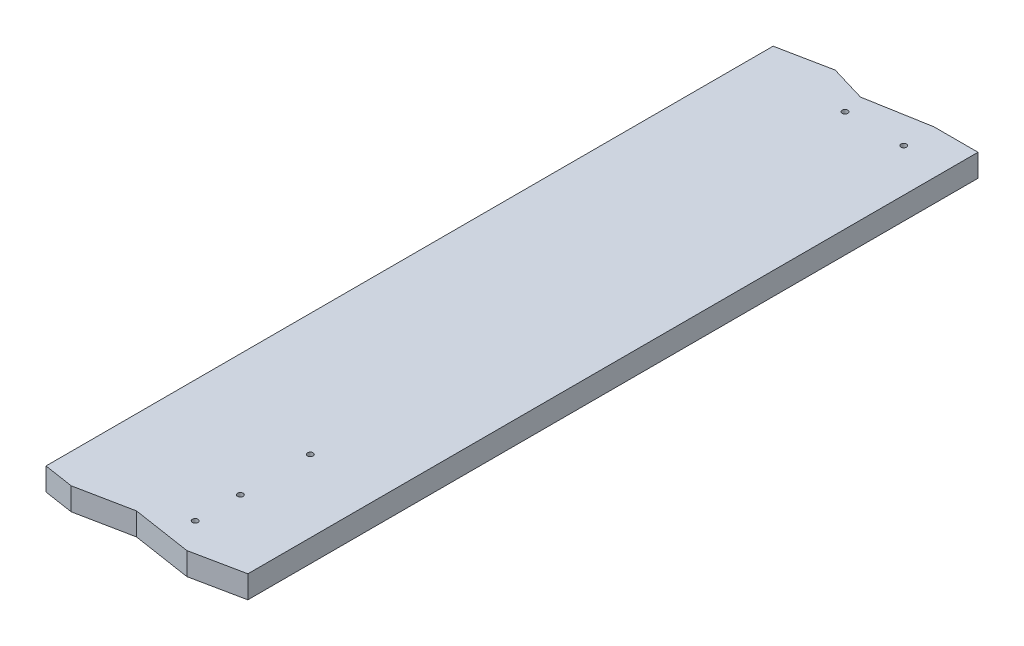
from build123d import *

# Parameters (mm, degrees)
EXTRUDE1_DEPTH = 10
SKETCH2_R      = 1.25
EXTRUDE2_DEPTH = 10


with BuildPart() as part:
    # Sketch1 → Extrude1 (new body)
    with BuildSketch(Plane(origin=(0, 0, 0), x_dir=(1, 0, 0), z_dir=(0, 1, 0))):
        Polygon((-33.795014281, 299.265761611), (-10.860026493, 303.852759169), (5.088277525, 299.080825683), (32.741741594, 303.947835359), (52.319462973, 303.947835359), (52.319462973, -19.611262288), (29.889022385, -24.212423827), (3.517178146, -20.155217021), (-20.624388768, -24.983530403), (-33.795014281, -22.957280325), align=None)
    extrude(amount=EXTRUDE1_DEPTH)

    # Sketch2 → Extrude2 (cut)
    with BuildSketch(Plane.XZ):
        with Locations(Location((33.319462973, -290.042719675, 0), (0, 0, 270))):
            Circle(SKETCH2_R)
        with Locations(Location((20.319462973, 10.957280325, 0), (0, 0, 270))):
            Circle(SKETCH2_R)
        with Locations(Location((20.319462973, -9.042719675, 0), (0, 0, 270))):
            Circle(SKETCH2_R)
        with Locations(Location((20.319462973, -40.042719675, 0), (0, 0, 270))):
            Circle(SKETCH2_R)
        with Locations(Location((7.319462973, -290.042719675, 0), (0, 0, 270))):
            Circle(SKETCH2_R)
    extrude(amount=-EXTRUDE2_DEPTH, mode=Mode.SUBTRACT)


solid = part.part
